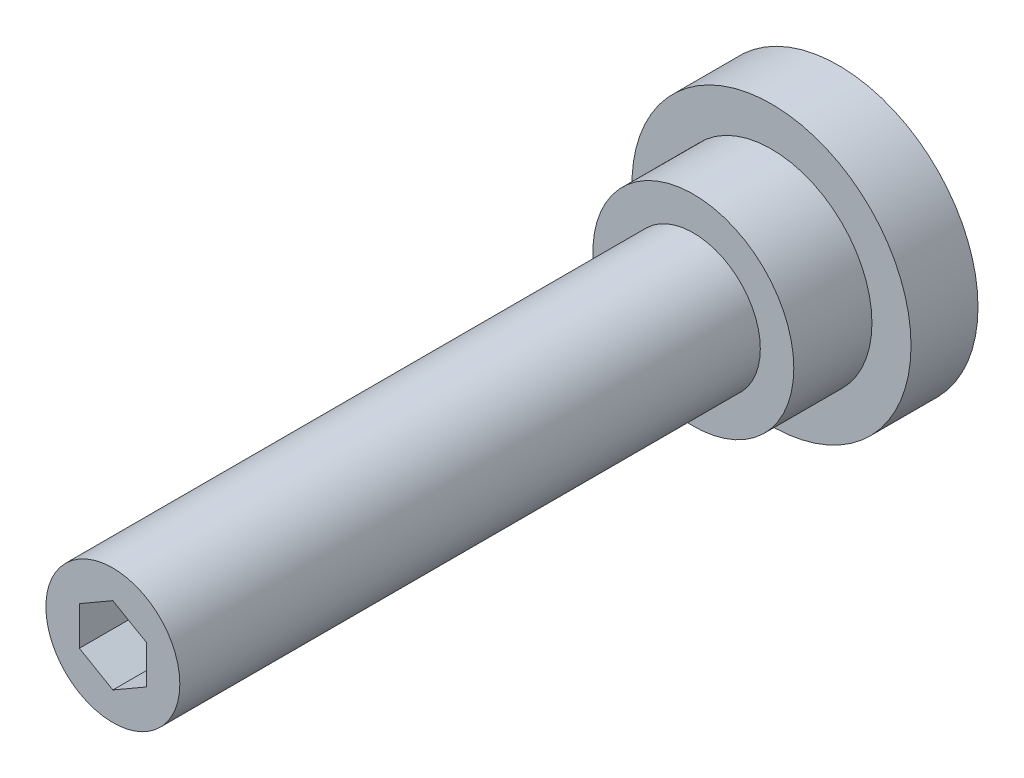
ISO-10303-21;
HEADER;
FILE_DESCRIPTION(('STEP AP214'),'2;1');
FILE_NAME('part.step','',(''),(''),'','','');
FILE_SCHEMA(('AUTOMOTIVE_DESIGN { 1 0 10303 214 1 1 1 1 }'));
ENDSEC;
DATA;
#1=APPLICATION_CONTEXT('core data for automotive mechanical design processes');
#2=APPLICATION_PROTOCOL_DEFINITION('international standard','automotive_design',2000,#1);
#3=PRODUCT_CONTEXT('',#1,'mechanical');
#4=PRODUCT('Part','Part','',(#3));
#5=PRODUCT_RELATED_PRODUCT_CATEGORY('part','',(#4));
#6=PRODUCT_DEFINITION_FORMATION('','',#4);
#7=PRODUCT_DEFINITION_CONTEXT('part definition',#1,'design');
#8=PRODUCT_DEFINITION('design','',#6,#7);
#9=PRODUCT_DEFINITION_SHAPE('','',#8);
#10=(LENGTH_UNIT() NAMED_UNIT(*) SI_UNIT(.MILLI.,.METRE.));
#11=(NAMED_UNIT(*) PLANE_ANGLE_UNIT() SI_UNIT($,.RADIAN.));
#12=(NAMED_UNIT(*) SI_UNIT($,.STERADIAN.) SOLID_ANGLE_UNIT());
#13=UNCERTAINTY_MEASURE_WITH_UNIT(LENGTH_MEASURE(1.E-05),#10,'distance_accuracy_value','');
#14=(GEOMETRIC_REPRESENTATION_CONTEXT(3) GLOBAL_UNCERTAINTY_ASSIGNED_CONTEXT((#13)) GLOBAL_UNIT_ASSIGNED_CONTEXT((#10,
#11,#12)) REPRESENTATION_CONTEXT('',''));
#15=CARTESIAN_POINT('',(0.,0.,0.));
#16=DIRECTION('',(0.,0.,1.));
#17=DIRECTION('',(1.,0.,0.));
#18=AXIS2_PLACEMENT_3D('',#15,#16,#17);
#19=CARTESIAN_POINT('',(0.,0.,0.));
#20=DIRECTION('',(0.,0.,1.));
#21=DIRECTION('',(1.,0.,0.));
#22=AXIS2_PLACEMENT_3D('',#19,#20,#21);
#23=PLANE('',#22);
#24=CARTESIAN_POINT('',(0.,0.,0.));
#25=DIRECTION('',(0.,0.,1.));
#26=DIRECTION('',(1.,0.,0.));
#27=AXIS2_PLACEMENT_3D('',#24,#25,#26);
#28=CIRCLE('',#27,12.5);
#29=CARTESIAN_POINT('',(12.5,0.,0.));
#30=VERTEX_POINT('',#29);
#31=EDGE_CURVE('E9',#30,#30,#28,.T.);
#32=ORIENTED_EDGE('',*,*,#31,.F.);
#33=EDGE_LOOP('',(#32));
#34=FACE_BOUND('',#33,.T.);
#35=ADVANCED_FACE('F14',(#34),#23,.F.);
#36=CARTESIAN_POINT('',(0.,0.,100.));
#37=DIRECTION('',(0.,0.,1.));
#38=DIRECTION('',(1.,0.,0.));
#39=AXIS2_PLACEMENT_3D('',#36,#37,#38);
#40=CYLINDRICAL_SURFACE('',#39,12.5);
#41=CARTESIAN_POINT('',(0.,0.,6.));
#42=DIRECTION('',(0.,0.,1.));
#43=DIRECTION('',(1.,0.,0.));
#44=AXIS2_PLACEMENT_3D('',#41,#42,#43);
#45=CIRCLE('',#44,12.5);
#46=CARTESIAN_POINT('',(12.5,0.,6.));
#47=VERTEX_POINT('',#46);
#48=EDGE_CURVE('E21',#47,#47,#45,.T.);
#49=ORIENTED_EDGE('',*,*,#48,.F.);
#50=EDGE_LOOP('',(#49));
#51=FACE_BOUND('',#50,.T.);
#52=ORIENTED_EDGE('',*,*,#31,.T.);
#53=EDGE_LOOP('',(#52));
#54=FACE_BOUND('',#53,.T.);
#55=ADVANCED_FACE('F138',(#51,#54),#40,.T.);
#56=CARTESIAN_POINT('',(12.5,0.,6.));
#57=DIRECTION('',(0.,0.,-1.));
#58=DIRECTION('',(-1.,0.,0.));
#59=AXIS2_PLACEMENT_3D('',#56,#57,#58);
#60=PLANE('',#59);
#61=CARTESIAN_POINT('',(0.,0.,6.));
#62=DIRECTION('',(0.,0.,1.));
#63=DIRECTION('',(1.,0.,0.));
#64=AXIS2_PLACEMENT_3D('',#61,#62,#63);
#65=CIRCLE('',#64,9.);
#66=CARTESIAN_POINT('',(9.,0.,6.));
#67=VERTEX_POINT('',#66);
#68=EDGE_CURVE('E131',#67,#67,#65,.T.);
#69=ORIENTED_EDGE('',*,*,#68,.F.);
#70=EDGE_LOOP('',(#69));
#71=FACE_BOUND('',#70,.T.);
#72=ORIENTED_EDGE('',*,*,#48,.T.);
#73=EDGE_LOOP('',(#72));
#74=FACE_BOUND('',#73,.T.);
#75=ADVANCED_FACE('F136',(#71,#74),#60,.F.);
#76=CARTESIAN_POINT('',(0.,0.,100.));
#77=DIRECTION('',(0.,0.,1.));
#78=DIRECTION('',(1.,0.,0.));
#79=AXIS2_PLACEMENT_3D('',#76,#77,#78);
#80=CYLINDRICAL_SURFACE('',#79,9.);
#81=CARTESIAN_POINT('',(0.,0.,13.));
#82=DIRECTION('',(0.,0.,1.));
#83=DIRECTION('',(1.,0.,0.));
#84=AXIS2_PLACEMENT_3D('',#81,#82,#83);
#85=CIRCLE('',#84,9.);
#86=CARTESIAN_POINT('',(9.,0.,13.));
#87=VERTEX_POINT('',#86);
#88=EDGE_CURVE('E128',#87,#87,#85,.T.);
#89=ORIENTED_EDGE('',*,*,#88,.F.);
#90=EDGE_LOOP('',(#89));
#91=FACE_BOUND('',#90,.T.);
#92=ORIENTED_EDGE('',*,*,#68,.T.);
#93=EDGE_LOOP('',(#92));
#94=FACE_BOUND('',#93,.T.);
#95=ADVANCED_FACE('F161',(#91,#94),#80,.T.);
#96=CARTESIAN_POINT('',(9.,0.,13.));
#97=DIRECTION('',(0.,0.,-1.));
#98=DIRECTION('',(-1.,0.,0.));
#99=AXIS2_PLACEMENT_3D('',#96,#97,#98);
#100=PLANE('',#99);
#101=CARTESIAN_POINT('',(0.,0.,13.));
#102=DIRECTION('',(0.,0.,1.));
#103=DIRECTION('',(1.,0.,0.));
#104=AXIS2_PLACEMENT_3D('',#101,#102,#103);
#105=CIRCLE('',#104,6.);
#106=CARTESIAN_POINT('',(6.,0.,13.));
#107=VERTEX_POINT('',#106);
#108=EDGE_CURVE('E125',#107,#107,#105,.T.);
#109=ORIENTED_EDGE('',*,*,#108,.F.);
#110=EDGE_LOOP('',(#109));
#111=FACE_BOUND('',#110,.T.);
#112=ORIENTED_EDGE('',*,*,#88,.T.);
#113=EDGE_LOOP('',(#112));
#114=FACE_BOUND('',#113,.T.);
#115=ADVANCED_FACE('F170',(#111,#114),#100,.F.);
#116=CARTESIAN_POINT('',(0.,0.,100.));
#117=DIRECTION('',(0.,0.,1.));
#118=DIRECTION('',(1.,0.,0.));
#119=AXIS2_PLACEMENT_3D('',#116,#117,#118);
#120=CYLINDRICAL_SURFACE('',#119,6.);
#121=CARTESIAN_POINT('',(0.,0.,65.));
#122=DIRECTION('',(0.,0.,1.));
#123=DIRECTION('',(1.,0.,0.));
#124=AXIS2_PLACEMENT_3D('',#121,#122,#123);
#125=CIRCLE('',#124,6.);
#126=CARTESIAN_POINT('',(6.,0.,65.));
#127=VERTEX_POINT('',#126);
#128=EDGE_CURVE('E116',#127,#127,#125,.T.);
#129=ORIENTED_EDGE('',*,*,#128,.F.);
#130=EDGE_LOOP('',(#129));
#131=FACE_BOUND('',#130,.T.);
#132=ORIENTED_EDGE('',*,*,#108,.T.);
#133=EDGE_LOOP('',(#132));
#134=FACE_BOUND('',#133,.T.);
#135=ADVANCED_FACE('F179',(#131,#134),#120,.T.);
#136=CARTESIAN_POINT('',(6.,0.,65.));
#137=DIRECTION('',(0.,0.,-1.));
#138=DIRECTION('',(-1.,0.,0.));
#139=AXIS2_PLACEMENT_3D('',#136,#137,#138);
#140=PLANE('',#139);
#141=DIRECTION('',(-0.866025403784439,-0.5,0.));
#142=VECTOR('',#141,1.);
#143=CARTESIAN_POINT('',(0.,3.46410161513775,65.));
#144=LINE('',#143,#142);
#145=CARTESIAN_POINT('',(0.,3.46410161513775,65.));
#146=VERTEX_POINT('',#145);
#147=CARTESIAN_POINT('',(-3.,1.73205080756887,65.));
#148=VERTEX_POINT('',#147);
#149=EDGE_CURVE('E82',#146,#148,#144,.T.);
#150=ORIENTED_EDGE('',*,*,#149,.F.);
#151=DIRECTION('',(-0.866025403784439,0.5,0.));
#152=VECTOR('',#151,1.);
#153=CARTESIAN_POINT('',(3.,1.73205080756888,65.));
#154=LINE('',#153,#152);
#155=CARTESIAN_POINT('',(3.,1.73205080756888,65.));
#156=VERTEX_POINT('',#155);
#157=EDGE_CURVE('E28',#156,#146,#154,.T.);
#158=ORIENTED_EDGE('',*,*,#157,.F.);
#159=DIRECTION('',(0.,1.,0.));
#160=VECTOR('',#159,1.);
#161=CARTESIAN_POINT('',(3.,-1.73205080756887,65.));
#162=LINE('',#161,#160);
#163=CARTESIAN_POINT('',(3.,-1.73205080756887,65.));
#164=VERTEX_POINT('',#163);
#165=EDGE_CURVE('E98',#164,#156,#162,.T.);
#166=ORIENTED_EDGE('',*,*,#165,.F.);
#167=DIRECTION('',(0.866025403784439,0.5,0.));
#168=VECTOR('',#167,1.);
#169=CARTESIAN_POINT('',(0.,-3.46410161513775,65.));
#170=LINE('',#169,#168);
#171=CARTESIAN_POINT('',(0.,-3.46410161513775,65.));
#172=VERTEX_POINT('',#171);
#173=EDGE_CURVE('E92',#172,#164,#170,.T.);
#174=ORIENTED_EDGE('',*,*,#173,.F.);
#175=DIRECTION('',(0.866025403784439,-0.5,0.));
#176=VECTOR('',#175,1.);
#177=CARTESIAN_POINT('',(-3.,-1.73205080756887,65.));
#178=LINE('',#177,#176);
#179=CARTESIAN_POINT('',(-3.,-1.73205080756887,65.));
#180=VERTEX_POINT('',#179);
#181=EDGE_CURVE('E90',#180,#172,#178,.T.);
#182=ORIENTED_EDGE('',*,*,#181,.F.);
#183=DIRECTION('',(0.,-1.,0.));
#184=VECTOR('',#183,1.);
#185=CARTESIAN_POINT('',(-3.,1.73205080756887,65.));
#186=LINE('',#185,#184);
#187=EDGE_CURVE('E71',#148,#180,#186,.T.);
#188=ORIENTED_EDGE('',*,*,#187,.F.);
#189=EDGE_LOOP('',(#150,#158,#166,#174,#182,#188));
#190=FACE_BOUND('',#189,.T.);
#191=ORIENTED_EDGE('',*,*,#128,.T.);
#192=EDGE_LOOP('',(#191));
#193=FACE_BOUND('',#192,.T.);
#194=ADVANCED_FACE('F86',(#190,#193),#140,.F.);
#195=CARTESIAN_POINT('',(3.,1.73205080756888,60.));
#196=DIRECTION('',(0.5,0.866025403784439,0.));
#197=DIRECTION('',(-0.866025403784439,0.5,0.));
#198=AXIS2_PLACEMENT_3D('',#195,#196,#197);
#199=PLANE('',#198);
#200=ORIENTED_EDGE('',*,*,#157,.T.);
#201=DIRECTION('',(0.,0.,1.));
#202=VECTOR('',#201,1.);
#203=CARTESIAN_POINT('',(0.,3.46410161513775,60.));
#204=LINE('',#203,#202);
#205=CARTESIAN_POINT('',(0.,3.46410161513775,60.));
#206=VERTEX_POINT('',#205);
#207=EDGE_CURVE('E79',#206,#146,#204,.T.);
#208=ORIENTED_EDGE('',*,*,#207,.F.);
#209=DIRECTION('',(-0.866025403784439,0.5,0.));
#210=VECTOR('',#209,1.);
#211=CARTESIAN_POINT('',(3.,1.73205080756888,60.));
#212=LINE('',#211,#210);
#213=CARTESIAN_POINT('',(3.,1.73205080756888,60.));
#214=VERTEX_POINT('',#213);
#215=EDGE_CURVE('E100',#214,#206,#212,.T.);
#216=ORIENTED_EDGE('',*,*,#215,.F.);
#217=DIRECTION('',(0.,0.,1.));
#218=VECTOR('',#217,1.);
#219=CARTESIAN_POINT('',(3.,1.73205080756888,60.));
#220=LINE('',#219,#218);
#221=EDGE_CURVE('E35',#214,#156,#220,.T.);
#222=ORIENTED_EDGE('',*,*,#221,.T.);
#223=EDGE_LOOP('',(#200,#208,#216,#222));
#224=FACE_BOUND('',#223,.T.);
#225=ADVANCED_FACE('F196',(#224),#199,.F.);
#226=CARTESIAN_POINT('',(3.,-1.73205080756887,60.));
#227=DIRECTION('',(1.,0.,0.));
#228=DIRECTION('',(0.,0.,-1.));
#229=AXIS2_PLACEMENT_3D('',#226,#227,#228);
#230=PLANE('',#229);
#231=ORIENTED_EDGE('',*,*,#165,.T.);
#232=ORIENTED_EDGE('',*,*,#221,.F.);
#233=DIRECTION('',(0.,1.,0.));
#234=VECTOR('',#233,1.);
#235=CARTESIAN_POINT('',(3.,-1.73205080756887,60.));
#236=LINE('',#235,#234);
#237=CARTESIAN_POINT('',(3.,-1.73205080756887,60.));
#238=VERTEX_POINT('',#237);
#239=EDGE_CURVE('E112',#238,#214,#236,.T.);
#240=ORIENTED_EDGE('',*,*,#239,.F.);
#241=DIRECTION('',(0.,0.,1.));
#242=VECTOR('',#241,1.);
#243=CARTESIAN_POINT('',(3.,-1.73205080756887,60.));
#244=LINE('',#243,#242);
#245=EDGE_CURVE('E117',#238,#164,#244,.T.);
#246=ORIENTED_EDGE('',*,*,#245,.T.);
#247=EDGE_LOOP('',(#231,#232,#240,#246));
#248=FACE_BOUND('',#247,.T.);
#249=ADVANCED_FACE('F204',(#248),#230,.F.);
#250=CARTESIAN_POINT('',(0.,-3.46410161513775,60.));
#251=DIRECTION('',(0.5,-0.866025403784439,0.));
#252=DIRECTION('',(0.866025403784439,0.5,0.));
#253=AXIS2_PLACEMENT_3D('',#250,#251,#252);
#254=PLANE('',#253);
#255=ORIENTED_EDGE('',*,*,#173,.T.);
#256=ORIENTED_EDGE('',*,*,#245,.F.);
#257=DIRECTION('',(0.866025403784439,0.5,0.));
#258=VECTOR('',#257,1.);
#259=CARTESIAN_POINT('',(0.,-3.46410161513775,60.));
#260=LINE('',#259,#258);
#261=CARTESIAN_POINT('',(0.,-3.46410161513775,60.));
#262=VERTEX_POINT('',#261);
#263=EDGE_CURVE('E109',#262,#238,#260,.T.);
#264=ORIENTED_EDGE('',*,*,#263,.F.);
#265=DIRECTION('',(0.,0.,1.));
#266=VECTOR('',#265,1.);
#267=CARTESIAN_POINT('',(0.,-3.46410161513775,60.));
#268=LINE('',#267,#266);
#269=EDGE_CURVE('E119',#262,#172,#268,.T.);
#270=ORIENTED_EDGE('',*,*,#269,.T.);
#271=EDGE_LOOP('',(#255,#256,#264,#270));
#272=FACE_BOUND('',#271,.T.);
#273=ADVANCED_FACE('F212',(#272),#254,.F.);
#274=CARTESIAN_POINT('',(-3.,-1.73205080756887,60.));
#275=DIRECTION('',(-0.5,-0.866025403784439,0.));
#276=DIRECTION('',(0.866025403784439,-0.5,0.));
#277=AXIS2_PLACEMENT_3D('',#274,#275,#276);
#278=PLANE('',#277);
#279=ORIENTED_EDGE('',*,*,#181,.T.);
#280=ORIENTED_EDGE('',*,*,#269,.F.);
#281=DIRECTION('',(0.866025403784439,-0.5,0.));
#282=VECTOR('',#281,1.);
#283=CARTESIAN_POINT('',(-3.,-1.73205080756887,60.));
#284=LINE('',#283,#282);
#285=CARTESIAN_POINT('',(-3.,-1.73205080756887,60.));
#286=VERTEX_POINT('',#285);
#287=EDGE_CURVE('E106',#286,#262,#284,.T.);
#288=ORIENTED_EDGE('',*,*,#287,.F.);
#289=DIRECTION('',(0.,0.,1.));
#290=VECTOR('',#289,1.);
#291=CARTESIAN_POINT('',(-3.,-1.73205080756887,60.));
#292=LINE('',#291,#290);
#293=EDGE_CURVE('E78',#286,#180,#292,.T.);
#294=ORIENTED_EDGE('',*,*,#293,.T.);
#295=EDGE_LOOP('',(#279,#280,#288,#294));
#296=FACE_BOUND('',#295,.T.);
#297=ADVANCED_FACE('F220',(#296),#278,.F.);
#298=CARTESIAN_POINT('',(-3.,1.73205080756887,60.));
#299=DIRECTION('',(-1.,0.,0.));
#300=DIRECTION('',(0.,0.,1.));
#301=AXIS2_PLACEMENT_3D('',#298,#299,#300);
#302=PLANE('',#301);
#303=ORIENTED_EDGE('',*,*,#187,.T.);
#304=ORIENTED_EDGE('',*,*,#293,.F.);
#305=DIRECTION('',(0.,-1.,0.));
#306=VECTOR('',#305,1.);
#307=CARTESIAN_POINT('',(-3.,1.73205080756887,60.));
#308=LINE('',#307,#306);
#309=CARTESIAN_POINT('',(-3.,1.73205080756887,60.));
#310=VERTEX_POINT('',#309);
#311=EDGE_CURVE('E74',#310,#286,#308,.T.);
#312=ORIENTED_EDGE('',*,*,#311,.F.);
#313=DIRECTION('',(0.,0.,1.));
#314=VECTOR('',#313,1.);
#315=CARTESIAN_POINT('',(-3.,1.73205080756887,60.));
#316=LINE('',#315,#314);
#317=EDGE_CURVE('E67',#310,#148,#316,.T.);
#318=ORIENTED_EDGE('',*,*,#317,.T.);
#319=EDGE_LOOP('',(#303,#304,#312,#318));
#320=FACE_BOUND('',#319,.T.);
#321=ADVANCED_FACE('F69',(#320),#302,.F.);
#322=CARTESIAN_POINT('',(0.,3.46410161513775,60.));
#323=DIRECTION('',(-0.5,0.866025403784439,0.));
#324=DIRECTION('',(-0.866025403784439,-0.5,0.));
#325=AXIS2_PLACEMENT_3D('',#322,#323,#324);
#326=PLANE('',#325);
#327=ORIENTED_EDGE('',*,*,#149,.T.);
#328=ORIENTED_EDGE('',*,*,#317,.F.);
#329=DIRECTION('',(-0.866025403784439,-0.5,0.));
#330=VECTOR('',#329,1.);
#331=CARTESIAN_POINT('',(0.,3.46410161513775,60.));
#332=LINE('',#331,#330);
#333=EDGE_CURVE('E103',#206,#310,#332,.T.);
#334=ORIENTED_EDGE('',*,*,#333,.F.);
#335=ORIENTED_EDGE('',*,*,#207,.T.);
#336=EDGE_LOOP('',(#327,#328,#334,#335));
#337=FACE_BOUND('',#336,.T.);
#338=ADVANCED_FACE('F83',(#337),#326,.F.);
#339=CARTESIAN_POINT('',(-3.,5.19615242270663,60.));
#340=DIRECTION('',(0.,0.,1.));
#341=DIRECTION('',(1.,0.,0.));
#342=AXIS2_PLACEMENT_3D('',#339,#340,#341);
#343=PLANE('',#342);
#344=ORIENTED_EDGE('',*,*,#215,.T.);
#345=ORIENTED_EDGE('',*,*,#333,.T.);
#346=ORIENTED_EDGE('',*,*,#311,.T.);
#347=ORIENTED_EDGE('',*,*,#287,.T.);
#348=ORIENTED_EDGE('',*,*,#263,.T.);
#349=ORIENTED_EDGE('',*,*,#239,.T.);
#350=EDGE_LOOP('',(#344,#345,#346,#347,#348,#349));
#351=FACE_BOUND('',#350,.T.);
#352=ADVANCED_FACE('F244',(#351),#343,.T.);
#353=CLOSED_SHELL('',(#35,#55,#75,#95,#115,#135,#194,#225,#249,#273,#297,#321,#338,#352));
#354=MANIFOLD_SOLID_BREP('B1',#353);
#355=ADVANCED_BREP_SHAPE_REPRESENTATION('',(#18,#354),#14);
#356=SHAPE_DEFINITION_REPRESENTATION(#9,#355);
ENDSEC;
END-ISO-10303-21;
